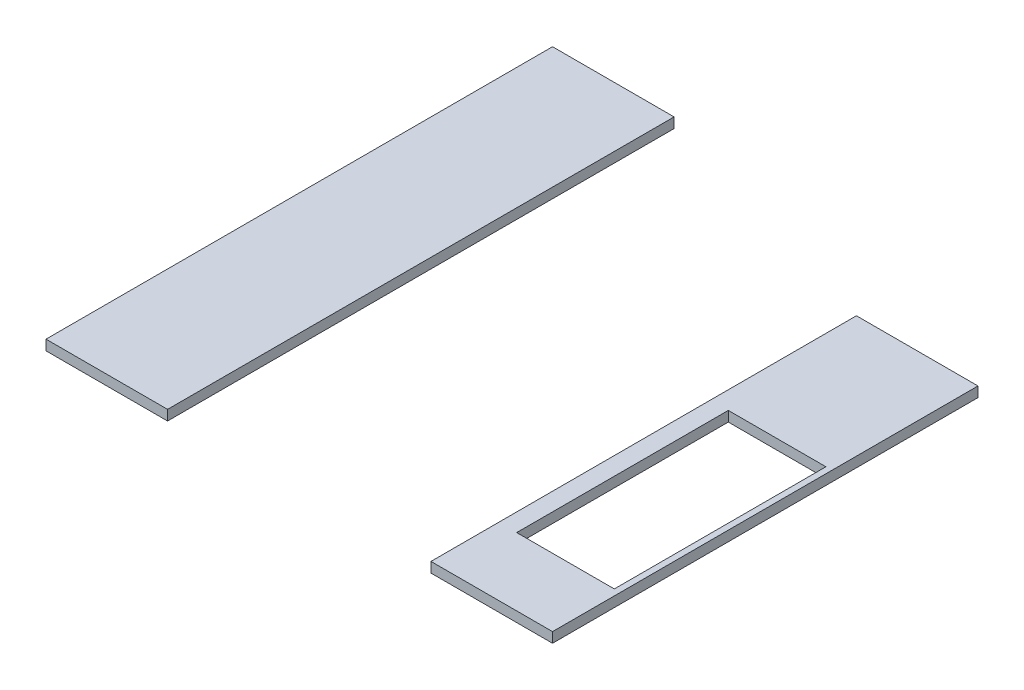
from build123d import *

# Parameters (mm, degrees)
ESQUISSE1_W             = 600
ESQUISSE1_H             = 2100
BOSS_EXTRU_1_DEPTH      = 50
ESQUISSE1_H_2           = 2500
BOSS_EXTRU_1_2_DEPTH    = 50
ESQUISSE2_W             = 481.790099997
ESQUISSE2_H             = 1044.446864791
ENL_V_MAT_EXTRU_1_DEPTH = 60


with BuildPart() as part:
    # Esquisse1 → Boss.-Extru.1 (new body)
    with BuildSketch(Plane(origin=(0, 0, 0), x_dir=(1, 0, 0), z_dir=(0, 1, 0))):
        with Locations((-300, 1050)):
            Rectangle(ESQUISSE1_W, ESQUISSE1_H)
    extrude(amount=BOSS_EXTRU_1_DEPTH)

    # Esquisse2 → Enl_v. mat.-Extru.1 (cut)
    with BuildSketch(Plane(origin=(0, 50, 0), x_dir=(1, 0, 0), z_dir=(0, 1, 0))):
        with Locations((-270.773174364, 857.05081483)):
            Rectangle(ESQUISSE2_W, ESQUISSE2_H)
    extrude(amount=-ENL_V_MAT_EXTRU_1_DEPTH, mode=Mode.SUBTRACT)


with BuildPart() as body_2:
    # Esquisse1 → Boss.-Extru.1 2 (new body)
    with BuildSketch(Plane(origin=(0, 0, 0), x_dir=(1, 0, 0), z_dir=(0, 1, 0))):
        with Locations((-2200, 1250)):
            Rectangle(ESQUISSE1_W, ESQUISSE1_H_2)
    extrude(amount=BOSS_EXTRU_1_2_DEPTH)


solid = Compound([part.part, body_2.part])
